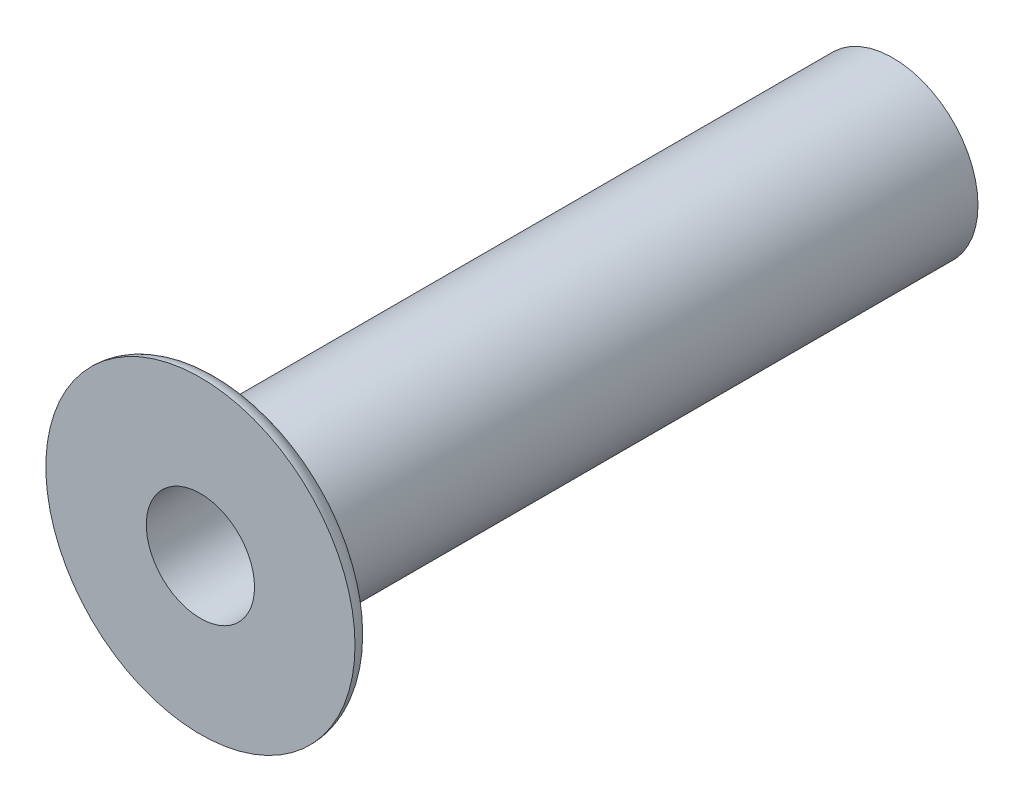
ISO-10303-21;
HEADER;
FILE_DESCRIPTION(('STEP AP214'),'2;1');
FILE_NAME('part.step','',(''),(''),'','','');
FILE_SCHEMA(('AUTOMOTIVE_DESIGN { 1 0 10303 214 1 1 1 1 }'));
ENDSEC;
DATA;
#1=APPLICATION_CONTEXT('core data for automotive mechanical design processes');
#2=APPLICATION_PROTOCOL_DEFINITION('international standard','automotive_design',2000,#1);
#3=PRODUCT_CONTEXT('',#1,'mechanical');
#4=PRODUCT('Part','Part','',(#3));
#5=PRODUCT_RELATED_PRODUCT_CATEGORY('part','',(#4));
#6=PRODUCT_DEFINITION_FORMATION('','',#4);
#7=PRODUCT_DEFINITION_CONTEXT('part definition',#1,'design');
#8=PRODUCT_DEFINITION('design','',#6,#7);
#9=PRODUCT_DEFINITION_SHAPE('','',#8);
#10=(LENGTH_UNIT() NAMED_UNIT(*) SI_UNIT(.MILLI.,.METRE.));
#11=(NAMED_UNIT(*) PLANE_ANGLE_UNIT() SI_UNIT($,.RADIAN.));
#12=(NAMED_UNIT(*) SI_UNIT($,.STERADIAN.) SOLID_ANGLE_UNIT());
#13=UNCERTAINTY_MEASURE_WITH_UNIT(LENGTH_MEASURE(1.E-05),#10,'distance_accuracy_value','');
#14=(GEOMETRIC_REPRESENTATION_CONTEXT(3) GLOBAL_UNCERTAINTY_ASSIGNED_CONTEXT((#13)) GLOBAL_UNIT_ASSIGNED_CONTEXT((#10,
#11,#12)) REPRESENTATION_CONTEXT('',''));
#15=CARTESIAN_POINT('',(0.,0.,0.));
#16=DIRECTION('',(0.,0.,1.));
#17=DIRECTION('',(1.,0.,0.));
#18=AXIS2_PLACEMENT_3D('',#15,#16,#17);
#19=CARTESIAN_POINT('',(0.,0.,28.448));
#20=DIRECTION('',(0.,0.,-1.));
#21=DIRECTION('',(-1.,0.,0.));
#22=AXIS2_PLACEMENT_3D('',#19,#20,#21);
#23=CYLINDRICAL_SURFACE('',#22,3.4925);
#24=CARTESIAN_POINT('',(0.,0.,26.924));
#25=DIRECTION('',(0.,0.,1.));
#26=DIRECTION('',(1.,0.,0.));
#27=AXIS2_PLACEMENT_3D('',#24,#25,#26);
#28=CIRCLE('',#27,3.4925);
#29=CARTESIAN_POINT('',(3.4925,0.,26.924));
#30=VERTEX_POINT('',#29);
#31=EDGE_CURVE('E10',#30,#30,#28,.F.);
#32=ORIENTED_EDGE('',*,*,#31,.T.);
#33=EDGE_LOOP('',(#32));
#34=FACE_BOUND('',#33,.T.);
#35=CARTESIAN_POINT('',(0.,0.,0.));
#36=DIRECTION('',(0.,0.,1.));
#37=DIRECTION('',(1.,0.,0.));
#38=AXIS2_PLACEMENT_3D('',#35,#36,#37);
#39=CIRCLE('',#38,3.4925);
#40=CARTESIAN_POINT('',(3.4925,0.,0.));
#41=VERTEX_POINT('',#40);
#42=EDGE_CURVE('E45',#41,#41,#39,.T.);
#43=ORIENTED_EDGE('',*,*,#42,.T.);
#44=EDGE_LOOP('',(#43));
#45=FACE_BOUND('',#44,.T.);
#46=ADVANCED_FACE('F30',(#34,#45),#23,.T.);
#47=CARTESIAN_POINT('',(0.,0.,28.448));
#48=DIRECTION('',(0.,0.,1.));
#49=DIRECTION('',(1.,0.,0.));
#50=AXIS2_PLACEMENT_3D('',#47,#48,#49);
#51=PLANE('',#50);
#52=CARTESIAN_POINT('',(0.,0.,28.448));
#53=DIRECTION('',(0.,0.,1.));
#54=DIRECTION('',(1.,0.,0.));
#55=AXIS2_PLACEMENT_3D('',#52,#53,#54);
#56=CIRCLE('',#55,2.2225);
#57=CARTESIAN_POINT('',(2.2225,0.,28.448));
#58=VERTEX_POINT('',#57);
#59=EDGE_CURVE('E50',#58,#58,#56,.T.);
#60=ORIENTED_EDGE('',*,*,#59,.F.);
#61=EDGE_LOOP('',(#60));
#62=FACE_BOUND('',#61,.T.);
#63=CARTESIAN_POINT('',(0.,0.,28.448));
#64=DIRECTION('',(0.,0.,1.));
#65=DIRECTION('',(1.,0.,0.));
#66=AXIS2_PLACEMENT_3D('',#63,#64,#65);
#67=CIRCLE('',#66,6.35);
#68=CARTESIAN_POINT('',(6.35,0.,28.448));
#69=VERTEX_POINT('',#68);
#70=EDGE_CURVE('E54',#69,#69,#67,.T.);
#71=ORIENTED_EDGE('',*,*,#70,.T.);
#72=EDGE_LOOP('',(#71));
#73=FACE_BOUND('',#72,.T.);
#74=ADVANCED_FACE('F60',(#62,#73),#51,.T.);
#75=CARTESIAN_POINT('',(0.,0.,0.));
#76=DIRECTION('',(0.,0.,1.));
#77=DIRECTION('',(1.,0.,0.));
#78=AXIS2_PLACEMENT_3D('',#75,#76,#77);
#79=PLANE('',#78);
#80=ORIENTED_EDGE('',*,*,#42,.F.);
#81=EDGE_LOOP('',(#80));
#82=FACE_BOUND('',#81,.T.);
#83=CARTESIAN_POINT('',(0.,0.,0.));
#84=DIRECTION('',(0.,0.,1.));
#85=DIRECTION('',(1.,0.,0.));
#86=AXIS2_PLACEMENT_3D('',#83,#84,#85);
#87=CIRCLE('',#86,2.2225);
#88=CARTESIAN_POINT('',(2.2225,0.,0.));
#89=VERTEX_POINT('',#88);
#90=EDGE_CURVE('E51',#89,#89,#87,.T.);
#91=ORIENTED_EDGE('',*,*,#90,.T.);
#92=EDGE_LOOP('',(#91));
#93=FACE_BOUND('',#92,.T.);
#94=ADVANCED_FACE('F76',(#82,#93),#79,.F.);
#95=CARTESIAN_POINT('',(0.,0.,28.448));
#96=DIRECTION('',(0.,0.,-1.));
#97=DIRECTION('',(-1.,0.,0.));
#98=AXIS2_PLACEMENT_3D('',#95,#96,#97);
#99=CYLINDRICAL_SURFACE('',#98,2.2225);
#100=ORIENTED_EDGE('',*,*,#59,.T.);
#101=EDGE_LOOP('',(#100));
#102=FACE_BOUND('',#101,.T.);
#103=ORIENTED_EDGE('',*,*,#90,.F.);
#104=EDGE_LOOP('',(#103));
#105=FACE_BOUND('',#104,.T.);
#106=ADVANCED_FACE('F82',(#102,#105),#99,.F.);
#107=CARTESIAN_POINT('',(0.,0.,27.686));
#108=DIRECTION('',(0.,0.,1.));
#109=DIRECTION('',(1.,0.,0.));
#110=AXIS2_PLACEMENT_3D('',#107,#108,#109);
#111=PLANE('',#110);
#112=CARTESIAN_POINT('',(0.,0.,27.686));
#113=DIRECTION('',(0.,0.,1.));
#114=DIRECTION('',(1.,0.,0.));
#115=AXIS2_PLACEMENT_3D('',#112,#113,#114);
#116=CIRCLE('',#115,4.2545);
#117=CARTESIAN_POINT('',(4.2545,0.,27.686));
#118=VERTEX_POINT('',#117);
#119=EDGE_CURVE('E37',#118,#118,#116,.T.);
#120=ORIENTED_EDGE('',*,*,#119,.T.);
#121=EDGE_LOOP('',(#120));
#122=FACE_BOUND('',#121,.T.);
#123=CARTESIAN_POINT('',(0.,0.,27.686));
#124=DIRECTION('',(0.,0.,1.));
#125=DIRECTION('',(1.,0.,0.));
#126=AXIS2_PLACEMENT_3D('',#123,#124,#125);
#127=CIRCLE('',#126,5.588);
#128=CARTESIAN_POINT('',(5.588,0.,27.686));
#129=VERTEX_POINT('',#128);
#130=EDGE_CURVE('E41',#129,#129,#127,.F.);
#131=ORIENTED_EDGE('',*,*,#130,.T.);
#132=EDGE_LOOP('',(#131));
#133=FACE_BOUND('',#132,.T.);
#134=ADVANCED_FACE('F68',(#122,#133),#111,.F.);
#135=CARTESIAN_POINT('',(0.,0.,26.924));
#136=DIRECTION('',(0.,0.,1.));
#137=DIRECTION('',(1.,0.,0.));
#138=AXIS2_PLACEMENT_3D('',#135,#136,#137);
#139=TOROIDAL_SURFACE('',#138,4.2545,0.762);
#140=ORIENTED_EDGE('',*,*,#31,.F.);
#141=EDGE_LOOP('',(#140));
#142=FACE_BOUND('',#141,.T.);
#143=ORIENTED_EDGE('',*,*,#119,.F.);
#144=EDGE_LOOP('',(#143));
#145=FACE_BOUND('',#144,.T.);
#146=ADVANCED_FACE('F63',(#142,#145),#139,.F.);
#147=CARTESIAN_POINT('',(0.,0.,28.448));
#148=DIRECTION('',(0.,0.,1.));
#149=DIRECTION('',(1.,0.,0.));
#150=AXIS2_PLACEMENT_3D('',#147,#148,#149);
#151=TOROIDAL_SURFACE('',#150,5.588,0.762);
#152=ORIENTED_EDGE('',*,*,#130,.F.);
#153=EDGE_LOOP('',(#152));
#154=FACE_BOUND('',#153,.T.);
#155=ORIENTED_EDGE('',*,*,#70,.F.);
#156=EDGE_LOOP('',(#155));
#157=FACE_BOUND('',#156,.T.);
#158=ADVANCED_FACE('F32',(#154,#157),#151,.T.);
#159=CLOSED_SHELL('',(#46,#74,#94,#106,#134,#146,#158));
#160=MANIFOLD_SOLID_BREP('B2',#159);
#161=ADVANCED_BREP_SHAPE_REPRESENTATION('',(#18,#160),#14);
#162=SHAPE_DEFINITION_REPRESENTATION(#9,#161);
ENDSEC;
END-ISO-10303-21;
